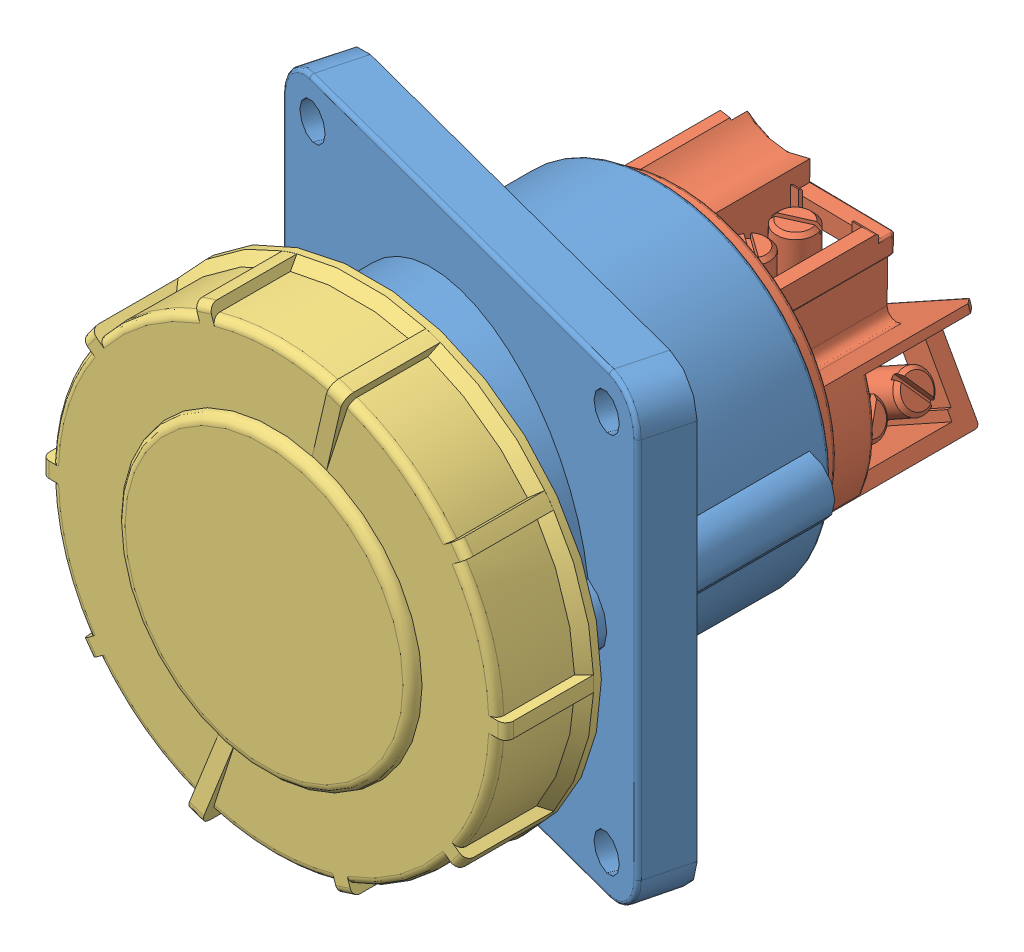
SolidWorks assembly Сборка4.sldasm, configuration По умолчанию (file format 10000). Lengths in mm.
Overall size (129.94 122 150.2).
3 component instances, 3 part files, 4 mates.
Components (placement in the parent):
- Корпус 4442,4452-1: Корпус 4442,4452.SLDPRT [По умолчанию] at (71.4027 76.0366 33.5785) size (129.88 120 88)
- Колодка 3452,4452-1: Колодка 3452,4452.SLDPRT [По умолчанию] at (71.4027 76.0366 33.5785) x (-0.514423 -0.857536 0) z (0 0 -1) size (83 83 129.5)
- Крышка 4442,4452,3442,3452-1: Крышка 4442,4452,3442,3452.SLDPRT [По умолчанию] at (71.3428 76.0366 134.6748) x (0.999999 0 0.001661) z (0.001661 0 -0.999999) size (126.06 122 45.5)
Mates (geometry in assembly coordinates):
- Концентричный1: concentric anti-aligned: cylinder of Корпус 4442,4452-1 through (71.4027 76.0366 39.5785) axis (0 0 1) radius 42.5; cylinder of Колодка 3452,4452-1 through (71.4027 76.0366 116.5785) axis (0 0 -1) radius 35
- Совпадение1: coincident anti-aligned: plane of Корпус 4442,4452-1 through (71.4027 76.0366 33.5785) normal (0 0 -1); plane of Колодка 3452,4452-1 through (71.4027 76.0366 33.5785) normal (0 0 1)
- Концентричный2: concentric aligned: cylinder of Корпус 4442,4452-1 through (13.4027 47.0366 98.5785) axis (0 1 0) radius 2.5; cylinder of Крышка 4442,4452,3442,3452-1 through (13.4027 65.0366 98.5785) axis (0 1 0) radius 2.5
- Расстояние1: distance = 0.5 mm anti-aligned: plane of Крышка 4442,4452,3442,3452-1 through (13.4027 65.0366 98.5785) normal (0 -1 0); plane of Корпус 4442,4452-1 through (2.5242 64.5366 76.5785) normal (0 1 0)
